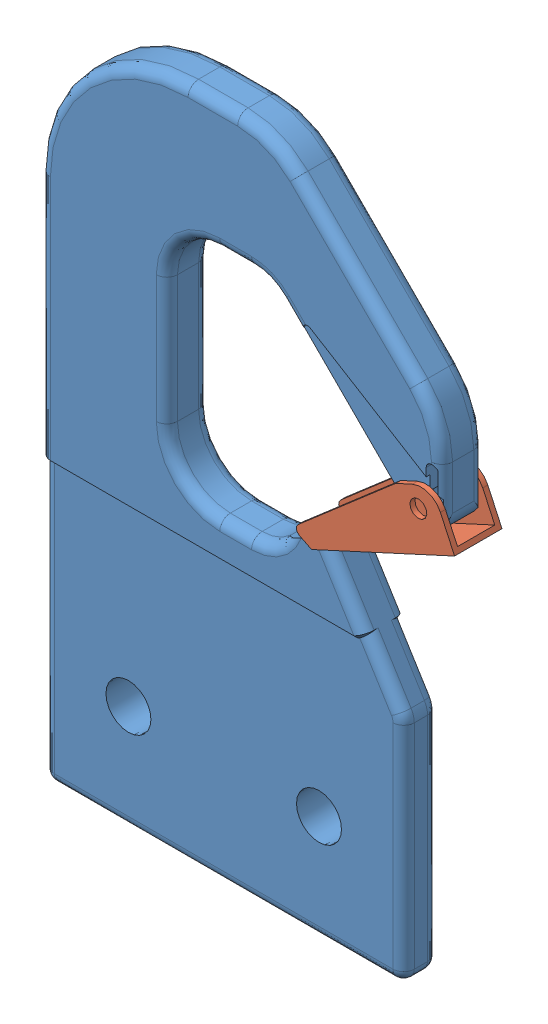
SolidWorks assembly Mapper_Recovery_Hook_3.SLDASM, configuration Default (file format 12000). Lengths in mm.
Overall size (125.16 203.2 14.22).
2 component instances, 2 part files, 2 mates.
Components (placement in the parent):
- Mapper_Recovery_Hook_2-1: Mapper_Recovery_Hook_2.SLDPRT [FEA] at (-51.7079 -35.4623 51.3781) size (120.65 203.2 13.89)
- Mapper_Recovery_Hook_Gate-1: Mapper_Recovery_Hook_Gate.SLDPRT [Default] at (73.4501 60.7918 50.6161) x (0 0 1) z (-0.908436 -0.418023 0) size (14.22 16.51 50.15)
Mates (geometry in assembly coordinates):
- Concentric1: concentric anti-aligned: cylinder of Mapper_Recovery_Hook_2-1 through (62.5921 67.6785 64.0781) axis (0 0 1) radius 3.3782; cylinder of Mapper_Recovery_Hook_Gate-1 through (62.5921 67.6785 50.6161) axis (0 0 -1) radius 2.5527
- Distance1: distance = 0.762 mm aligned: plane of Mapper_Recovery_Hook_2-1 through (-51.7079 142.3377 64.0781) normal (0 0 1); plane of Mapper_Recovery_Hook_Gate-1 through (21.533 36.9018 64.8401) normal (0 0 1)
